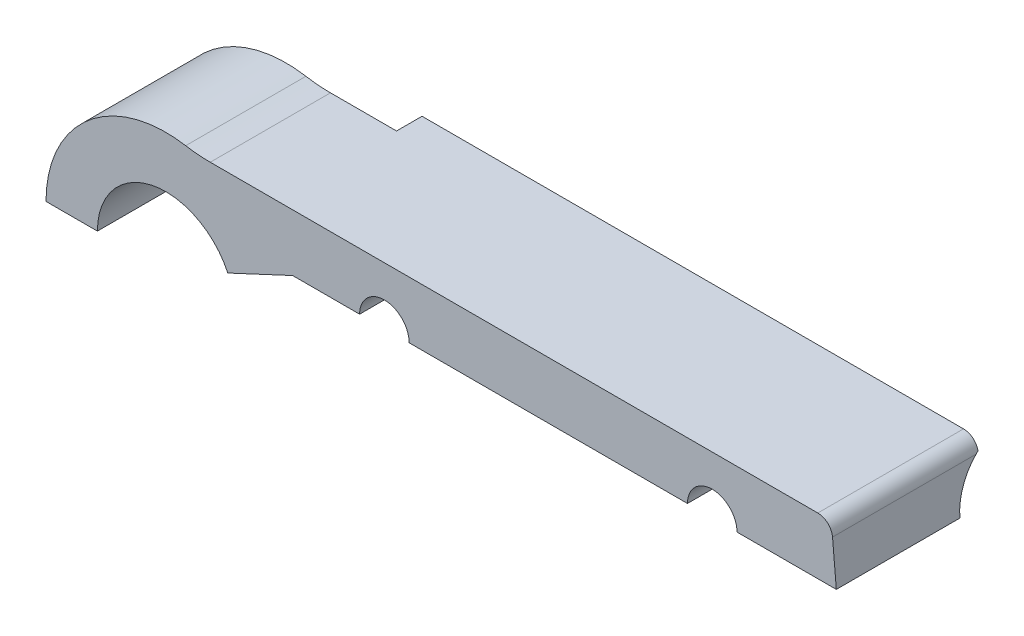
ISO-10303-21;
HEADER;
FILE_DESCRIPTION(('STEP AP214'),'2;1');
FILE_NAME('part.step','',(''),(''),'','','');
FILE_SCHEMA(('AUTOMOTIVE_DESIGN { 1 0 10303 214 1 1 1 1 }'));
ENDSEC;
DATA;
#1=APPLICATION_CONTEXT('core data for automotive mechanical design processes');
#2=APPLICATION_PROTOCOL_DEFINITION('international standard','automotive_design',2000,#1);
#3=PRODUCT_CONTEXT('',#1,'mechanical');
#4=PRODUCT('Part','Part','',(#3));
#5=PRODUCT_RELATED_PRODUCT_CATEGORY('part','',(#4));
#6=PRODUCT_DEFINITION_FORMATION('','',#4);
#7=PRODUCT_DEFINITION_CONTEXT('part definition',#1,'design');
#8=PRODUCT_DEFINITION('design','',#6,#7);
#9=PRODUCT_DEFINITION_SHAPE('','',#8);
#10=(LENGTH_UNIT() NAMED_UNIT(*) SI_UNIT(.MILLI.,.METRE.));
#11=(NAMED_UNIT(*) PLANE_ANGLE_UNIT() SI_UNIT($,.RADIAN.));
#12=(NAMED_UNIT(*) SI_UNIT($,.STERADIAN.) SOLID_ANGLE_UNIT());
#13=UNCERTAINTY_MEASURE_WITH_UNIT(LENGTH_MEASURE(1.E-05),#10,'distance_accuracy_value','');
#14=(GEOMETRIC_REPRESENTATION_CONTEXT(3) GLOBAL_UNCERTAINTY_ASSIGNED_CONTEXT((#13)) GLOBAL_UNIT_ASSIGNED_CONTEXT((#10,
#11,#12)) REPRESENTATION_CONTEXT('',''));
#15=CARTESIAN_POINT('',(0.,0.,0.));
#16=DIRECTION('',(0.,0.,1.));
#17=DIRECTION('',(1.,0.,0.));
#18=AXIS2_PLACEMENT_3D('',#15,#16,#17);
#19=CARTESIAN_POINT('',(17.4133961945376,8.12,-144.932167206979));
#20=DIRECTION('',(0.,-1.,0.));
#21=DIRECTION('',(0.,0.,-1.));
#22=AXIS2_PLACEMENT_3D('',#19,#20,#21);
#23=PLANE('',#22);
#24=DIRECTION('',(1.,0.,0.));
#25=VECTOR('',#24,1.);
#26=CARTESIAN_POINT('',(30.8284770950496,8.12,20.));
#27=LINE('',#26,#25);
#28=CARTESIAN_POINT('',(17.4133961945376,8.12,20.));
#29=VERTEX_POINT('',#28);
#30=CARTESIAN_POINT('',(26.6,8.12,20.));
#31=VERTEX_POINT('',#30);
#32=EDGE_CURVE('E161',#29,#31,#27,.T.);
#33=ORIENTED_EDGE('',*,*,#32,.F.);
#34=DIRECTION('',(0.,0.,1.));
#35=VECTOR('',#34,1.);
#36=CARTESIAN_POINT('',(17.4133961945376,8.12,-144.932167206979));
#37=LINE('',#36,#35);
#38=CARTESIAN_POINT('',(17.4133961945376,8.12,3.5));
#39=VERTEX_POINT('',#38);
#40=EDGE_CURVE('E280',#39,#29,#37,.T.);
#41=ORIENTED_EDGE('',*,*,#40,.F.);
#42=DIRECTION('',(-1.,0.,0.));
#43=VECTOR('',#42,1.);
#44=CARTESIAN_POINT('',(0.,8.12,3.5));
#45=LINE('',#44,#43);
#46=CARTESIAN_POINT('',(20.4466525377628,8.12,3.5));
#47=VERTEX_POINT('',#46);
#48=EDGE_CURVE('E167',#47,#39,#45,.T.);
#49=ORIENTED_EDGE('',*,*,#48,.F.);
#50=DIRECTION('',(0.,0.,-1.));
#51=VECTOR('',#50,1.);
#52=CARTESIAN_POINT('',(20.4466525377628,8.12,3.5));
#53=LINE('',#52,#51);
#54=CARTESIAN_POINT('',(20.4466525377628,8.12,3.045));
#55=VERTEX_POINT('',#54);
#56=EDGE_CURVE('E279',#47,#55,#53,.T.);
#57=ORIENTED_EDGE('',*,*,#56,.T.);
#58=DIRECTION('',(1.,0.,0.));
#59=VECTOR('',#58,1.);
#60=CARTESIAN_POINT('',(-16.445,8.12,3.045));
#61=LINE('',#60,#59);
#62=CARTESIAN_POINT('',(26.6,8.12,3.045));
#63=VERTEX_POINT('',#62);
#64=EDGE_CURVE('E173',#55,#63,#61,.T.);
#65=ORIENTED_EDGE('',*,*,#64,.T.);
#66=DIRECTION('',(0.,0.,1.));
#67=VECTOR('',#66,1.);
#68=CARTESIAN_POINT('',(26.6,8.12,20.));
#69=LINE('',#68,#67);
#70=EDGE_CURVE('E154',#63,#31,#69,.T.);
#71=ORIENTED_EDGE('',*,*,#70,.T.);
#72=EDGE_LOOP('',(#33,#41,#49,#57,#65,#71));
#73=FACE_BOUND('',#72,.T.);
#74=ADVANCED_FACE('F35',(#73),#23,.T.);
#75=CARTESIAN_POINT('',(0.,0.,-144.932167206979));
#76=DIRECTION('',(0.4226182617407,-0.90630778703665,0.));
#77=DIRECTION('',(0.90630778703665,0.4226182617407,0.));
#78=AXIS2_PLACEMENT_3D('',#75,#76,#77);
#79=PLANE('',#78);
#80=DIRECTION('',(0.90630778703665,0.4226182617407,0.));
#81=VECTOR('',#80,1.);
#82=CARTESIAN_POINT('',(17.6637907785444,8.23676091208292,20.));
#83=LINE('',#82,#81);
#84=CARTESIAN_POINT('',(8.51023012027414,3.96838547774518,20.));
#85=VERTEX_POINT('',#84);
#86=EDGE_CURVE('E50',#85,#29,#83,.T.);
#87=ORIENTED_EDGE('',*,*,#86,.F.);
#88=DIRECTION('',(0.,0.,-1.));
#89=VECTOR('',#88,1.);
#90=CARTESIAN_POINT('',(8.51023012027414,3.96838547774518,20.));
#91=LINE('',#90,#89);
#92=CARTESIAN_POINT('',(8.51023012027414,3.96838547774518,3.5));
#93=VERTEX_POINT('',#92);
#94=EDGE_CURVE('E43',#85,#93,#91,.T.);
#95=ORIENTED_EDGE('',*,*,#94,.T.);
#96=DIRECTION('',(-0.90630778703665,-0.4226182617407,0.));
#97=VECTOR('',#96,1.);
#98=CARTESIAN_POINT('',(0.,0.,3.5));
#99=LINE('',#98,#97);
#100=EDGE_CURVE('E190',#39,#93,#99,.T.);
#101=ORIENTED_EDGE('',*,*,#100,.F.);
#102=ORIENTED_EDGE('',*,*,#40,.T.);
#103=EDGE_LOOP('',(#87,#95,#101,#102));
#104=FACE_BOUND('',#103,.T.);
#105=ADVANCED_FACE('F189',(#104),#79,.T.);
#106=CARTESIAN_POINT('',(0.,0.,20.));
#107=DIRECTION('',(0.,0.,-1.));
#108=DIRECTION('',(-1.,0.,0.));
#109=AXIS2_PLACEMENT_3D('',#106,#107,#108);
#110=CYLINDRICAL_SURFACE('',#109,16.445);
#111=DIRECTION('',(0.,0.,-1.));
#112=VECTOR('',#111,1.);
#113=CARTESIAN_POINT('',(-16.445,0.,20.));
#114=LINE('',#113,#112);
#115=CARTESIAN_POINT('',(-16.445,0.,20.));
#116=VERTEX_POINT('',#115);
#117=CARTESIAN_POINT('',(-16.445,0.,3.5));
#118=VERTEX_POINT('',#117);
#119=EDGE_CURVE('E58',#116,#118,#114,.T.);
#120=ORIENTED_EDGE('',*,*,#119,.F.);
#121=CARTESIAN_POINT('',(0.,0.,20.));
#122=DIRECTION('',(0.,0.,1.));
#123=DIRECTION('',(1.,0.,0.));
#124=AXIS2_PLACEMENT_3D('',#121,#122,#123);
#125=CIRCLE('',#124,16.445);
#126=CARTESIAN_POINT('',(2.73037716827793,16.216752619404,20.));
#127=VERTEX_POINT('',#126);
#128=EDGE_CURVE('E330',#127,#116,#125,.T.);
#129=ORIENTED_EDGE('',*,*,#128,.F.);
#130=DIRECTION('',(0.,0.,-1.));
#131=VECTOR('',#130,1.);
#132=CARTESIAN_POINT('',(2.73037716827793,16.216752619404,20.));
#133=LINE('',#132,#131);
#134=CARTESIAN_POINT('',(2.73037716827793,16.216752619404,3.5));
#135=VERTEX_POINT('',#134);
#136=EDGE_CURVE('E332',#127,#135,#133,.T.);
#137=ORIENTED_EDGE('',*,*,#136,.T.);
#138=CARTESIAN_POINT('',(0.,0.,3.5));
#139=DIRECTION('',(0.,0.,-1.));
#140=DIRECTION('',(-1.,0.,0.));
#141=AXIS2_PLACEMENT_3D('',#138,#139,#140);
#142=CIRCLE('',#141,16.445);
#143=EDGE_CURVE('E178',#118,#135,#142,.T.);
#144=ORIENTED_EDGE('',*,*,#143,.F.);
#145=EDGE_LOOP('',(#120,#129,#137,#144));
#146=FACE_BOUND('',#145,.T.);
#147=ADVANCED_FACE('F255',(#146),#110,.T.);
#148=CARTESIAN_POINT('',(30.8284770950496,-19.995,20.));
#149=DIRECTION('',(0.,0.,1.));
#150=DIRECTION('',(1.,0.,0.));
#151=AXIS2_PLACEMENT_3D('',#148,#149,#150);
#152=PLANE('',#151);
#153=ORIENTED_EDGE('',*,*,#128,.T.);
#154=DIRECTION('',(1.,0.,0.));
#155=VECTOR('',#154,1.);
#156=CARTESIAN_POINT('',(30.8284770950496,0.,20.));
#157=LINE('',#156,#155);
#158=CARTESIAN_POINT('',(-9.39,0.,20.));
#159=VERTEX_POINT('',#158);
#160=EDGE_CURVE('E199',#116,#159,#157,.T.);
#161=ORIENTED_EDGE('',*,*,#160,.T.);
#162=CARTESIAN_POINT('',(0.,0.,20.));
#163=DIRECTION('',(0.,0.,-1.));
#164=DIRECTION('',(-1.,0.,0.));
#165=AXIS2_PLACEMENT_3D('',#162,#163,#164);
#166=CIRCLE('',#165,9.39);
#167=EDGE_CURVE('E194',#159,#85,#166,.T.);
#168=ORIENTED_EDGE('',*,*,#167,.T.);
#169=ORIENTED_EDGE('',*,*,#86,.T.);
#170=ORIENTED_EDGE('',*,*,#32,.T.);
#171=CARTESIAN_POINT('',(30.,8.12,20.));
#172=DIRECTION('',(0.,0.,1.));
#173=DIRECTION('',(1.,0.,0.));
#174=AXIS2_PLACEMENT_3D('',#171,#172,#173);
#175=CIRCLE('',#174,3.39999999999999);
#176=CARTESIAN_POINT('',(33.4,8.12,20.));
#177=VERTEX_POINT('',#176);
#178=EDGE_CURVE('E151',#177,#31,#175,.T.);
#179=ORIENTED_EDGE('',*,*,#178,.F.);
#180=CARTESIAN_POINT('',(71.6,8.12,20.));
#181=VERTEX_POINT('',#180);
#182=EDGE_CURVE('E170',#177,#181,#27,.T.);
#183=ORIENTED_EDGE('',*,*,#182,.T.);
#184=CARTESIAN_POINT('',(75.,8.12,20.));
#185=DIRECTION('',(0.,0.,1.));
#186=DIRECTION('',(1.,0.,0.));
#187=AXIS2_PLACEMENT_3D('',#184,#185,#186);
#188=CIRCLE('',#187,3.39999999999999);
#189=CARTESIAN_POINT('',(78.4,8.12,20.));
#190=VERTEX_POINT('',#189);
#191=EDGE_CURVE('E239',#190,#181,#188,.T.);
#192=ORIENTED_EDGE('',*,*,#191,.F.);
#193=CARTESIAN_POINT('',(92.0337239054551,8.12,20.));
#194=VERTEX_POINT('',#193);
#195=EDGE_CURVE('E169',#190,#194,#27,.T.);
#196=ORIENTED_EDGE('',*,*,#195,.T.);
#197=DIRECTION('',(-0.0871557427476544,0.996194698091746,0.));
#198=VECTOR('',#197,1.);
#199=CARTESIAN_POINT('',(91.5121229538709,14.0819261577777,20.));
#200=LINE('',#199,#198);
#201=CARTESIAN_POINT('',(91.5121229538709,14.0819261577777,20.));
#202=VERTEX_POINT('',#201);
#203=EDGE_CURVE('E322',#194,#202,#200,.T.);
#204=ORIENTED_EDGE('',*,*,#203,.T.);
#205=CARTESIAN_POINT('',(89.4898477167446,13.905,20.));
#206=DIRECTION('',(0.,0.,1.));
#207=DIRECTION('',(-1.,0.,0.));
#208=AXIS2_PLACEMENT_3D('',#205,#206,#207);
#209=CIRCLE('',#208,2.03);
#210=CARTESIAN_POINT('',(89.4898477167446,15.935,20.));
#211=VERTEX_POINT('',#210);
#212=EDGE_CURVE('E324',#202,#211,#209,.T.);
#213=ORIENTED_EDGE('',*,*,#212,.T.);
#214=DIRECTION('',(-1.,0.,0.));
#215=VECTOR('',#214,1.);
#216=CARTESIAN_POINT('',(6.10080322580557,15.935,20.));
#217=LINE('',#216,#215);
#218=CARTESIAN_POINT('',(6.10080322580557,15.935,20.));
#219=VERTEX_POINT('',#218);
#220=EDGE_CURVE('E326',#211,#219,#217,.T.);
#221=ORIENTED_EDGE('',*,*,#220,.T.);
#222=CARTESIAN_POINT('',(6.10080322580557,36.235,20.));
#223=DIRECTION('',(0.,0.,-1.));
#224=DIRECTION('',(1.,0.,0.));
#225=AXIS2_PLACEMENT_3D('',#222,#223,#224);
#226=CIRCLE('',#225,20.3);
#227=EDGE_CURVE('E328',#219,#127,#226,.T.);
#228=ORIENTED_EDGE('',*,*,#227,.T.);
#229=EDGE_LOOP('',(#153,#161,#168,#169,#170,#179,#183,#192,#196,#204,#213,#221,#228));
#230=FACE_BOUND('',#229,.T.);
#231=ADVANCED_FACE('F162',(#230),#152,.T.);
#232=CARTESIAN_POINT('',(0.,0.,3.5));
#233=DIRECTION('',(0.,0.,-1.));
#234=DIRECTION('',(-1.,0.,0.));
#235=AXIS2_PLACEMENT_3D('',#232,#233,#234);
#236=PLANE('',#235);
#237=CARTESIAN_POINT('',(0.,0.,3.5));
#238=DIRECTION('',(0.,0.,-1.));
#239=DIRECTION('',(-1.,0.,0.));
#240=AXIS2_PLACEMENT_3D('',#237,#238,#239);
#241=CIRCLE('',#240,9.39);
#242=CARTESIAN_POINT('',(-9.39,0.,3.5));
#243=VERTEX_POINT('',#242);
#244=EDGE_CURVE('E197',#243,#93,#241,.T.);
#245=ORIENTED_EDGE('',*,*,#244,.F.);
#246=DIRECTION('',(-1.,0.,0.));
#247=VECTOR('',#246,1.);
#248=CARTESIAN_POINT('',(0.,0.,3.5));
#249=LINE('',#248,#247);
#250=EDGE_CURVE('E292',#243,#118,#249,.T.);
#251=ORIENTED_EDGE('',*,*,#250,.T.);
#252=ORIENTED_EDGE('',*,*,#143,.T.);
#253=CARTESIAN_POINT('',(6.10080322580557,36.235,3.5));
#254=DIRECTION('',(0.,0.,-1.));
#255=DIRECTION('',(-1.,0.,0.));
#256=AXIS2_PLACEMENT_3D('',#253,#254,#255);
#257=CIRCLE('',#256,20.3);
#258=CARTESIAN_POINT('',(6.10080322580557,15.935,3.5));
#259=VERTEX_POINT('',#258);
#260=EDGE_CURVE('E312',#135,#259,#257,.F.);
#261=ORIENTED_EDGE('',*,*,#260,.T.);
#262=DIRECTION('',(1.,0.,0.));
#263=VECTOR('',#262,1.);
#264=CARTESIAN_POINT('',(6.10080322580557,15.935,3.5));
#265=LINE('',#264,#263);
#266=CARTESIAN_POINT('',(15.1682489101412,15.935,3.5));
#267=VERTEX_POINT('',#266);
#268=EDGE_CURVE('E308',#259,#267,#265,.T.);
#269=ORIENTED_EDGE('',*,*,#268,.T.);
#270=CARTESIAN_POINT('',(0.,0.,3.5));
#271=DIRECTION('',(0.,0.,-1.));
#272=DIRECTION('',(-1.,0.,0.));
#273=AXIS2_PLACEMENT_3D('',#270,#271,#272);
#274=CIRCLE('',#273,22.);
#275=EDGE_CURVE('E306',#267,#47,#274,.T.);
#276=ORIENTED_EDGE('',*,*,#275,.T.);
#277=ORIENTED_EDGE('',*,*,#48,.T.);
#278=ORIENTED_EDGE('',*,*,#100,.T.);
#279=EDGE_LOOP('',(#245,#251,#252,#261,#269,#276,#277,#278));
#280=FACE_BOUND('',#279,.T.);
#281=ADVANCED_FACE('F227',(#280),#236,.T.);
#282=CARTESIAN_POINT('',(0.,0.,3.5));
#283=DIRECTION('',(0.,0.,-1.));
#284=DIRECTION('',(-1.,0.,0.));
#285=AXIS2_PLACEMENT_3D('',#282,#283,#284);
#286=CYLINDRICAL_SURFACE('',#285,22.);
#287=ORIENTED_EDGE('',*,*,#56,.F.);
#288=ORIENTED_EDGE('',*,*,#275,.F.);
#289=DIRECTION('',(0.,0.,-1.));
#290=VECTOR('',#289,1.);
#291=CARTESIAN_POINT('',(15.1682489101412,15.935,3.5));
#292=LINE('',#291,#290);
#293=CARTESIAN_POINT('',(15.1682489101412,15.935,0.));
#294=VERTEX_POINT('',#293);
#295=EDGE_CURVE('E310',#294,#267,#292,.F.);
#296=ORIENTED_EDGE('',*,*,#295,.F.);
#297=CARTESIAN_POINT('',(0.,0.,0.));
#298=DIRECTION('',(0.,0.,-1.));
#299=DIRECTION('',(-1.,0.,0.));
#300=AXIS2_PLACEMENT_3D('',#297,#298,#299);
#301=CIRCLE('',#300,22.);
#302=CARTESIAN_POINT('',(16.7096325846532,14.3104220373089,0.));
#303=VERTEX_POINT('',#302);
#304=EDGE_CURVE('E302',#294,#303,#301,.T.);
#305=ORIENTED_EDGE('',*,*,#304,.T.);
#306=CARTESIAN_POINT('',(16.7096325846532,14.3104220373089,0.));
#307=CARTESIAN_POINT('',(16.7869290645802,14.2201700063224,0.117114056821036));
#308=CARTESIAN_POINT('',(16.8654322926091,14.1270211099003,0.231140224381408));
#309=CARTESIAN_POINT('',(17.024305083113,13.9351545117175,0.453000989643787));
#310=CARTESIAN_POINT('',(17.1046743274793,13.8364377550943,0.56083663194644));
#311=CARTESIAN_POINT('',(17.3477648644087,13.5322703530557,0.875045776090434));
#312=CARTESIAN_POINT('',(17.5125035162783,13.3187625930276,1.07217313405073));
#313=CARTESIAN_POINT('',(17.8442086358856,12.870985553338,1.4418475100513));
#314=CARTESIAN_POINT('',(18.0111817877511,12.6366272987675,1.61428010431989));
#315=CARTESIAN_POINT('',(18.34341232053,12.1493261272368,1.93249108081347));
#316=CARTESIAN_POINT('',(18.5086699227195,11.8963856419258,2.0782729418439));
#317=CARTESIAN_POINT('',(18.8110840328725,11.4110791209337,2.3226602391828));
#318=CARTESIAN_POINT('',(18.9488618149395,11.1809913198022,2.42503574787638));
#319=CARTESIAN_POINT('',(19.2193206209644,10.7094141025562,2.60787811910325));
#320=CARTESIAN_POINT('',(19.3520026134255,10.467926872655,2.68834916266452));
#321=CARTESIAN_POINT('',(19.6104360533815,9.97536966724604,2.82585949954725));
#322=CARTESIAN_POINT('',(19.7362000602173,9.7243185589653,2.8829425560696));
#323=CARTESIAN_POINT('',(19.9795607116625,9.21395872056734,2.97238789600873));
#324=CARTESIAN_POINT('',(20.0971579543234,8.9546505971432,3.00475199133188));
#325=CARTESIAN_POINT('',(20.3146521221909,8.4489705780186,3.04188483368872));
#326=CARTESIAN_POINT('',(20.4152140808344,8.20301941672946,3.04848005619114));
#327=CARTESIAN_POINT('',(20.6071966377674,7.70804022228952,3.03805821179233));
#328=CARTESIAN_POINT('',(20.6986175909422,7.45901230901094,3.02104206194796));
#329=CARTESIAN_POINT('',(20.8715054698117,6.96058785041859,2.96258652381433));
#330=CARTESIAN_POINT('',(20.9529808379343,6.71119180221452,2.92116802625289));
#331=CARTESIAN_POINT('',(21.1055862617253,6.21463248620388,2.81342327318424));
#332=CARTESIAN_POINT('',(21.1767180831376,5.96746884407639,2.74710127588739));
#333=CARTESIAN_POINT('',(21.2990827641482,5.51328152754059,2.60073864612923));
#334=CARTESIAN_POINT('',(21.351706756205,5.30556076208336,2.52400385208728));
#335=CARTESIAN_POINT('',(21.449346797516,4.89590063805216,2.35240872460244));
#336=CARTESIAN_POINT('',(21.4943634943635,4.69396078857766,2.25754993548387));
#337=CARTESIAN_POINT('',(21.5770641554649,4.29781991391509,2.05020139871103));
#338=CARTESIAN_POINT('',(21.6147490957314,4.1036178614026,1.93771400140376));
#339=CARTESIAN_POINT('',(21.6832408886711,3.72479598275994,1.69582456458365));
#340=CARTESIAN_POINT('',(21.7140489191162,3.54017451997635,1.56642542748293));
#341=CARTESIAN_POINT('',(21.7623836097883,3.22753525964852,1.32642856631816));
#342=CARTESIAN_POINT('',(21.7812987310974,3.097009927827,1.21935141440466));
#343=CARTESIAN_POINT('',(21.8159151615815,2.84293458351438,0.996743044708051));
#344=CARTESIAN_POINT('',(21.8316167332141,2.71938400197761,0.881212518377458));
#345=CARTESIAN_POINT('',(21.8601012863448,2.48001755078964,0.6423351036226));
#346=CARTESIAN_POINT('',(21.872887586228,2.36419299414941,0.518997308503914));
#347=CARTESIAN_POINT('',(21.8958950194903,2.14065652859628,0.264913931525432));
#348=CARTESIAN_POINT('',(21.9061157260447,2.03294597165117,0.134167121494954));
#349=CARTESIAN_POINT('',(21.9152168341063,1.92957796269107,0.));
#350=B_SPLINE_CURVE_WITH_KNOTS('',3,(#306,#307,#308,#309,#310,#311,#312,#313,#314,#315,#316,
#317,#318,#319,#320,#321,#322,#323,#324,#325,#326,#327,#328,#329,#330,#331,#332,#333,#334,#335,
#336,#337,#338,#339,#340,#341,#342,#343,#344,#345,#346,#347,#348,#349),.UNSPECIFIED.,.F.,.F.,(4,
2,2,2,2,2,2,2,2,2,2,2,2,2,2,2,2,2,2,2,2,4),(0.,0.50038990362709,1.00069512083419,2.001084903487,
3.00596962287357,4.01072307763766,4.87086930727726,5.73085124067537,6.58921655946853,
7.44751895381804,8.24374704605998,9.03994421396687,9.83546074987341,10.6308413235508,
11.3127782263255,11.9946570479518,12.6764450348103,13.3581161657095,13.8674030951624,
14.3766484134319,14.8853111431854,15.3940584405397),.UNSPECIFIED.);
#351=EDGE_CURVE('E174',#303,#55,#350,.T.);
#352=ORIENTED_EDGE('',*,*,#351,.T.);
#353=EDGE_LOOP('',(#287,#288,#296,#305,#352));
#354=FACE_BOUND('',#353,.T.);
#355=ADVANCED_FACE('F224',(#354),#286,.F.);
#356=CARTESIAN_POINT('',(-16.445,8.12,-4.77));
#357=DIRECTION('',(1.,0.,0.));
#358=DIRECTION('',(0.,0.,-1.));
#359=AXIS2_PLACEMENT_3D('',#356,#357,#358);
#360=CYLINDRICAL_SURFACE('',#359,7.815);
#361=ORIENTED_EDGE('',*,*,#64,.F.);
#362=ORIENTED_EDGE('',*,*,#351,.F.);
#363=DIRECTION('',(1.,0.,0.));
#364=VECTOR('',#363,1.);
#365=CARTESIAN_POINT('',(-16.445,14.3104220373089,0.));
#366=LINE('',#365,#364);
#367=CARTESIAN_POINT('',(91.4789512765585,14.3104220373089,0.));
#368=VERTEX_POINT('',#367);
#369=EDGE_CURVE('E200',#368,#303,#366,.F.);
#370=ORIENTED_EDGE('',*,*,#369,.F.);
#371=CARTESIAN_POINT('',(91.5121229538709,14.0819261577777,0.282688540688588));
#372=CARTESIAN_POINT('',(91.5104042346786,14.1015699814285,0.259509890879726));
#373=CARTESIAN_POINT('',(91.5084100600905,14.1210682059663,0.236228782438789));
#374=CARTESIAN_POINT('',(91.5038926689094,14.1597591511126,0.189481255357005));
#375=CARTESIAN_POINT('',(91.5013696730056,14.1789519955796,0.166014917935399));
#376=CARTESIAN_POINT('',(91.4958150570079,14.2170341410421,0.118897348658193));
#377=CARTESIAN_POINT('',(91.4927834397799,14.2359234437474,0.0952461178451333));
#378=CARTESIAN_POINT('',(91.4862300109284,14.2734015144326,0.0477578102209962));
#379=CARTESIAN_POINT('',(91.482707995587,14.2919901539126,0.0239206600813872));
#380=CARTESIAN_POINT('',(91.4789512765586,14.3104220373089,0.));
#381=B_SPLINE_CURVE_WITH_KNOTS('',3,(#371,#372,#373,#374,#375,#376,#377,#378,#379,#380),
.UNSPECIFIED.,.F.,.F.,(4,2,2,2,4),(0.,0.0912925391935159,0.182547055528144,0.273801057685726,
0.3650930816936),.UNSPECIFIED.);
#382=CARTESIAN_POINT('',(91.5121229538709,14.0819261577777,0.282688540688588));
#383=VERTEX_POINT('',#382);
#384=EDGE_CURVE('E203',#383,#368,#381,.T.);
#385=ORIENTED_EDGE('',*,*,#384,.F.);
#386=CARTESIAN_POINT('',(92.0337239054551,8.12,-4.77));
#387=DIRECTION('',(-0.996194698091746,-0.0871557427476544,0.));
#388=DIRECTION('',(0.0871557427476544,-0.996194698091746,0.));
#389=AXIS2_PLACEMENT_3D('',#386,#387,#388);
#390=ELLIPSE('',#389,7.84485203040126,7.815);
#391=CARTESIAN_POINT('',(92.0337239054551,8.12,3.04500000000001));
#392=VERTEX_POINT('',#391);
#393=EDGE_CURVE('E214',#392,#383,#390,.T.);
#394=ORIENTED_EDGE('',*,*,#393,.F.);
#395=CARTESIAN_POINT('',(78.4,8.12,3.045));
#396=VERTEX_POINT('',#395);
#397=EDGE_CURVE('E276',#396,#392,#61,.T.);
#398=ORIENTED_EDGE('',*,*,#397,.F.);
#399=CARTESIAN_POINT('',(78.4,8.12,3.045));
#400=CARTESIAN_POINT('',(78.3999992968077,8.21074674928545,3.04499942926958));
#401=CARTESIAN_POINT('',(78.3963619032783,8.30151946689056,3.04341505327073));
#402=CARTESIAN_POINT('',(78.3818486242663,8.48241256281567,3.03711752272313));
#403=CARTESIAN_POINT('',(78.3709684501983,8.57253252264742,3.03240251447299));
#404=CARTESIAN_POINT('',(78.3420540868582,8.75159312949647,3.01995367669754));
#405=CARTESIAN_POINT('',(78.324006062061,8.84053114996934,3.01221400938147));
#406=CARTESIAN_POINT('',(78.280951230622,9.01642252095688,2.99392251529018));
#407=CARTESIAN_POINT('',(78.2559415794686,9.10337504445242,2.98336953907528));
#408=CARTESIAN_POINT('',(78.1710305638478,9.3596783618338,2.94796423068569));
#409=CARTESIAN_POINT('',(78.1011101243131,9.52530913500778,2.91930381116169));
#410=CARTESIAN_POINT('',(77.9369773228,9.84222982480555,2.85459183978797));
#411=CARTESIAN_POINT('',(77.8427711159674,9.99352336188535,2.81854216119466));
#412=CARTESIAN_POINT('',(77.6273797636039,10.2859720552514,2.74044548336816));
#413=CARTESIAN_POINT('',(77.5050964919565,10.4262638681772,2.69819084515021));
#414=CARTESIAN_POINT('',(77.2393569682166,10.6850974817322,2.61329859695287));
#415=CARTESIAN_POINT('',(77.0958886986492,10.8036268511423,2.57066078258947));
#416=CARTESIAN_POINT('',(76.7823467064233,11.0220146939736,2.48720033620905));
#417=CARTESIAN_POINT('',(76.6112463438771,11.1204955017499,2.44660492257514));
#418=CARTESIAN_POINT('',(76.2528972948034,11.2868930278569,2.37515745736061));
#419=CARTESIAN_POINT('',(76.0656577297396,11.3548268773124,2.34429994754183));
#420=CARTESIAN_POINT('',(75.6902932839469,11.454552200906,2.29808923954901));
#421=CARTESIAN_POINT('',(75.5027036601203,11.4880147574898,2.28202367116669));
#422=CARTESIAN_POINT('',(75.1239376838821,11.5230502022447,2.26518965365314));
#423=CARTESIAN_POINT('',(74.9327636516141,11.5246430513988,2.26441162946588));
#424=CARTESIAN_POINT('',(74.5696293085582,11.4971443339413,2.2776433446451));
#425=CARTESIAN_POINT('',(74.3974172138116,11.4706497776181,2.29040157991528));
#426=CARTESIAN_POINT('',(74.0601827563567,11.3921141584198,2.32713697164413));
#427=CARTESIAN_POINT('',(73.8951619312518,11.3400676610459,2.35111651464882));
#428=CARTESIAN_POINT('',(73.5726453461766,11.210876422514,2.40814520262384));
#429=CARTESIAN_POINT('',(73.415396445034,11.1332024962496,2.44138305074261));
#430=CARTESIAN_POINT('',(73.1155175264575,10.9553393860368,2.51314894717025));
#431=CARTESIAN_POINT('',(72.9728935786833,10.8551409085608,2.55167917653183));
#432=CARTESIAN_POINT('',(72.6923614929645,10.6241572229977,2.63403874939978));
#433=CARTESIAN_POINT('',(72.5561232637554,10.4913949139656,2.67802779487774));
#434=CARTESIAN_POINT('',(72.3072555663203,10.204513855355,2.76335321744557));
#435=CARTESIAN_POINT('',(72.1946326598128,10.0503891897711,2.80468885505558));
#436=CARTESIAN_POINT('',(71.9934355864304,9.7196922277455,2.88145456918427));
#437=CARTESIAN_POINT('',(71.905599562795,9.54262305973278,2.91669324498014));
#438=CARTESIAN_POINT('',(71.7615593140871,9.17429506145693,2.97579769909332));
#439=CARTESIAN_POINT('',(71.7053359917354,8.9830448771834,2.99967034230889));
#440=CARTESIAN_POINT('',(71.6297483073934,8.60568751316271,3.03203458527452));
#441=CARTESIAN_POINT('',(71.6081465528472,8.42010851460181,3.04145795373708));
#442=CARTESIAN_POINT('',(71.5956721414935,8.04775038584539,3.04688106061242));
#443=CARTESIAN_POINT('',(71.6047896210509,7.86097166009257,3.04288510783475));
#444=CARTESIAN_POINT('',(71.6519472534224,7.50238481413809,3.02251438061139));
#445=CARTESIAN_POINT('',(71.6883646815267,7.33031913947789,3.00683441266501));
#446=CARTESIAN_POINT('',(71.7867717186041,6.99496025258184,2.96544282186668));
#447=CARTESIAN_POINT('',(71.8487644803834,6.83166812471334,2.93972996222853));
#448=CARTESIAN_POINT('',(71.9985616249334,6.51270861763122,2.87970662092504));
#449=CARTESIAN_POINT('',(72.0871120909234,6.3574389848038,2.84515257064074));
#450=CARTESIAN_POINT('',(72.2866967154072,6.06340238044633,2.77106487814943));
#451=CARTESIAN_POINT('',(72.3977405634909,5.92464256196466,2.73152909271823));
#452=CARTESIAN_POINT('',(72.6492022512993,5.65623607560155,2.64790785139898));
#453=CARTESIAN_POINT('',(72.7912297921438,5.52812954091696,2.60370728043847));
#454=CARTESIAN_POINT('',(73.0953704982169,5.29708118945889,2.51838524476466));
#455=CARTESIAN_POINT('',(73.2574898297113,5.19414712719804,2.47726473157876));
#456=CARTESIAN_POINT('',(73.6017082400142,5.01465257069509,2.40221959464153));
#457=CARTESIAN_POINT('',(73.7841437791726,4.93866459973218,2.36845646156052));
#458=CARTESIAN_POINT('',(74.1611652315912,4.81918721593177,2.31401360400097));
#459=CARTESIAN_POINT('',(74.3557397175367,4.77566772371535,2.29332177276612));
#460=CARTESIAN_POINT('',(74.7342813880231,4.72547452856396,2.26932702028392));
#461=CARTESIAN_POINT('',(74.9178050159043,4.7160650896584,2.2647340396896));
#462=CARTESIAN_POINT('',(75.2837419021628,4.72692241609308,2.26997807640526));
#463=CARTESIAN_POINT('',(75.4661553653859,4.74718352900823,2.27981234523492));
#464=CARTESIAN_POINT('',(75.8142448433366,4.81444300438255,2.31157961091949));
#465=CARTESIAN_POINT('',(75.9802886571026,4.85990130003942,2.33281368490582));
#466=CARTESIAN_POINT('',(76.3023936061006,4.97468210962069,2.38437882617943));
#467=CARTESIAN_POINT('',(76.4584518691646,5.04401145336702,2.41471249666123));
#468=CARTESIAN_POINT('',(76.7668901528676,5.20956358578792,2.48341906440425));
#469=CARTESIAN_POINT('',(76.9184218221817,5.30720333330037,2.52217753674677));
#470=CARTESIAN_POINT('',(77.2038045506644,5.52472402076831,2.60239372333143));
#471=CARTESIAN_POINT('',(77.337648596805,5.64461373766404,2.64385249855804));
#472=CARTESIAN_POINT('',(77.5952142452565,5.91488593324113,2.72889174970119));
#473=CARTESIAN_POINT('',(77.7171947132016,6.06696641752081,2.77236581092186));
#474=CARTESIAN_POINT('',(77.9340903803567,6.39110593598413,2.85318472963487));
#475=CARTESIAN_POINT('',(78.0289932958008,6.56317398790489,2.89052680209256));
#476=CARTESIAN_POINT('',(78.1478707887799,6.83145131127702,2.93856997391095));
#477=CARTESIAN_POINT('',(78.1834354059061,6.92198506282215,2.95318998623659));
#478=CARTESIAN_POINT('',(78.2467734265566,7.10613465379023,2.97951131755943));
#479=CARTESIAN_POINT('',(78.2745505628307,7.1997489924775,2.99121403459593));
#480=CARTESIAN_POINT('',(78.321944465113,7.38911401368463,3.01132908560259));
#481=CARTESIAN_POINT('',(78.3415809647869,7.48485893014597,3.01974937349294));
#482=CARTESIAN_POINT('',(78.3725461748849,7.67787751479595,3.03308241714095));
#483=CARTESIAN_POINT('',(78.3838807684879,7.77515005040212,3.03799765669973));
#484=CARTESIAN_POINT('',(78.3939972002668,7.91387860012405,3.04238996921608));
#485=CARTESIAN_POINT('',(78.3962474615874,7.95506243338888,3.04336803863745));
#486=CARTESIAN_POINT('',(78.3992490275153,8.03749572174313,3.0446731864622));
#487=CARTESIAN_POINT('',(78.4000003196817,8.07874517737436,3.04500025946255));
#488=CARTESIAN_POINT('',(78.4,8.12,3.045));
#489=B_SPLINE_CURVE_WITH_KNOTS('',3,(#399,#400,#401,#402,#403,#404,#405,#406,#407,#408,#409,
#410,#411,#412,#413,#414,#415,#416,#417,#418,#419,#420,#421,#422,#423,#424,#425,#426,#427,#428,
#429,#430,#431,#432,#433,#434,#435,#436,#437,#438,#439,#440,#441,#442,#443,#444,#445,#446,#447,
#448,#449,#450,#451,#452,#453,#454,#455,#456,#457,#458,#459,#460,#461,#462,#463,#464,#465,#466,
#467,#468,#469,#470,#471,#472,#473,#474,#475,#476,#477,#478,#479,#480,#481,#482,#483,#484,#485,
#486,#487,#488),.UNSPECIFIED.,.T.,.F.,(4,2,2,2,2,2,2,2,2,2,2,2,2,2,2,2,2,2,2,2,2,2,2,2,2,2,2,2,
2,2,2,2,2,2,2,2,2,2,2,2,2,2,2,2,4),(0.,0.272198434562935,0.544558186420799,0.817446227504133,
1.09044593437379,1.63393457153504,2.17728559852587,2.74733274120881,3.31770450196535,
3.91930654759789,4.52057078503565,5.0910775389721,5.6612269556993,6.18290723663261,
6.70469851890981,7.23801987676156,7.77156168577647,8.35468502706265,8.93797018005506,
9.53713411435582,10.1359357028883,10.6942039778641,11.2522930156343,11.7796051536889,
12.3069823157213,12.8508402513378,13.3949329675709,13.981200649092,14.5676487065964,
15.1659002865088,15.7635969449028,16.312141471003,16.8605815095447,17.378701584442,
17.8969700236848,18.4478277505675,18.9989032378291,19.5953578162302,20.1920825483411,
20.4868375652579,20.7814510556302,21.0753461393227,21.3690327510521,21.492777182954,
21.6165226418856),.UNSPECIFIED.);
#490=CARTESIAN_POINT('',(71.6,8.12,3.045));
#491=VERTEX_POINT('',#490);
#492=EDGE_CURVE('E205',#396,#491,#489,.T.);
#493=ORIENTED_EDGE('',*,*,#492,.T.);
#494=CARTESIAN_POINT('',(33.4,8.12,3.045));
#495=VERTEX_POINT('',#494);
#496=EDGE_CURVE('E166',#495,#491,#61,.T.);
#497=ORIENTED_EDGE('',*,*,#496,.F.);
#498=CARTESIAN_POINT('',(33.4,8.12,3.045));
#499=CARTESIAN_POINT('',(33.3999992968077,8.21074674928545,3.04499942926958));
#500=CARTESIAN_POINT('',(33.3963619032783,8.30151946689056,3.04341505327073));
#501=CARTESIAN_POINT('',(33.3818486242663,8.48241256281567,3.03711752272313));
#502=CARTESIAN_POINT('',(33.3709684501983,8.57253252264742,3.03240251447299));
#503=CARTESIAN_POINT('',(33.3420540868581,8.75159312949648,3.01995367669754));
#504=CARTESIAN_POINT('',(33.324006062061,8.84053114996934,3.01221400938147));
#505=CARTESIAN_POINT('',(33.280951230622,9.01642252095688,2.99392251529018));
#506=CARTESIAN_POINT('',(33.2559415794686,9.10337504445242,2.98336953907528));
#507=CARTESIAN_POINT('',(33.1710305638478,9.3596783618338,2.94796423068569));
#508=CARTESIAN_POINT('',(33.1011101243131,9.52530913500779,2.91930381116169));
#509=CARTESIAN_POINT('',(32.9369773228,9.84222982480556,2.85459183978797));
#510=CARTESIAN_POINT('',(32.8427711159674,9.99352336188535,2.81854216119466));
#511=CARTESIAN_POINT('',(32.6273797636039,10.2859720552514,2.74044548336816));
#512=CARTESIAN_POINT('',(32.5050964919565,10.4262638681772,2.69819084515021));
#513=CARTESIAN_POINT('',(32.2393569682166,10.6850974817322,2.61329859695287));
#514=CARTESIAN_POINT('',(32.0958886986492,10.8036268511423,2.57066078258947));
#515=CARTESIAN_POINT('',(31.7823467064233,11.0220146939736,2.48720033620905));
#516=CARTESIAN_POINT('',(31.6112463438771,11.1204955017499,2.44660492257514));
#517=CARTESIAN_POINT('',(31.2528972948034,11.2868930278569,2.37515745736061));
#518=CARTESIAN_POINT('',(31.0656577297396,11.3548268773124,2.34429994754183));
#519=CARTESIAN_POINT('',(30.6902932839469,11.454552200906,2.29808923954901));
#520=CARTESIAN_POINT('',(30.5027036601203,11.4880147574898,2.28202367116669));
#521=CARTESIAN_POINT('',(30.1239376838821,11.5230502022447,2.26518965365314));
#522=CARTESIAN_POINT('',(29.9327636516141,11.5246430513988,2.26441162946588));
#523=CARTESIAN_POINT('',(29.5696293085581,11.4971443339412,2.2776433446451));
#524=CARTESIAN_POINT('',(29.3974172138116,11.4706497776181,2.29040157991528));
#525=CARTESIAN_POINT('',(29.0601827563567,11.3921141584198,2.32713697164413));
#526=CARTESIAN_POINT('',(28.8951619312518,11.3400676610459,2.35111651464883));
#527=CARTESIAN_POINT('',(28.5726453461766,11.210876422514,2.40814520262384));
#528=CARTESIAN_POINT('',(28.415396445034,11.1332024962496,2.44138305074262));
#529=CARTESIAN_POINT('',(28.1155175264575,10.9553393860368,2.51314894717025));
#530=CARTESIAN_POINT('',(27.9728935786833,10.8551409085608,2.55167917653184));
#531=CARTESIAN_POINT('',(27.6923614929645,10.6241572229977,2.63403874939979));
#532=CARTESIAN_POINT('',(27.5561232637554,10.4913949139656,2.67802779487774));
#533=CARTESIAN_POINT('',(27.3072555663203,10.204513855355,2.76335321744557));
#534=CARTESIAN_POINT('',(27.1946326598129,10.0503891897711,2.80468885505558));
#535=CARTESIAN_POINT('',(26.9934355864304,9.7196922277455,2.88145456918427));
#536=CARTESIAN_POINT('',(26.905599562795,9.54262305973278,2.91669324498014));
#537=CARTESIAN_POINT('',(26.7615593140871,9.17429506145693,2.97579769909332));
#538=CARTESIAN_POINT('',(26.7053359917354,8.98304487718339,2.99967034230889));
#539=CARTESIAN_POINT('',(26.6297483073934,8.6056875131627,3.03203458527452));
#540=CARTESIAN_POINT('',(26.6081465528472,8.4201085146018,3.04145795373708));
#541=CARTESIAN_POINT('',(26.5956721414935,8.04775038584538,3.04688106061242));
#542=CARTESIAN_POINT('',(26.6047896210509,7.86097166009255,3.04288510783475));
#543=CARTESIAN_POINT('',(26.6519472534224,7.50238481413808,3.02251438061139));
#544=CARTESIAN_POINT('',(26.6883646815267,7.33031913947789,3.00683441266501));
#545=CARTESIAN_POINT('',(26.7867717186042,6.99496025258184,2.96544282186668));
#546=CARTESIAN_POINT('',(26.8487644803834,6.83166812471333,2.93972996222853));
#547=CARTESIAN_POINT('',(26.9985616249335,6.51270861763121,2.87970662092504));
#548=CARTESIAN_POINT('',(27.0871120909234,6.35743898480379,2.84515257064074));
#549=CARTESIAN_POINT('',(27.2866967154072,6.06340238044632,2.77106487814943));
#550=CARTESIAN_POINT('',(27.3977405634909,5.92464256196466,2.73152909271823));
#551=CARTESIAN_POINT('',(27.6492022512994,5.65623607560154,2.64790785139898));
#552=CARTESIAN_POINT('',(27.7912297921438,5.52812954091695,2.60370728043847));
#553=CARTESIAN_POINT('',(28.0953704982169,5.29708118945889,2.51838524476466));
#554=CARTESIAN_POINT('',(28.2574898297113,5.19414712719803,2.47726473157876));
#555=CARTESIAN_POINT('',(28.6017082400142,5.01465257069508,2.40221959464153));
#556=CARTESIAN_POINT('',(28.7841437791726,4.93866459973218,2.36845646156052));
#557=CARTESIAN_POINT('',(29.1611652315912,4.81918721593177,2.31401360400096));
#558=CARTESIAN_POINT('',(29.3557397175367,4.77566772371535,2.29332177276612));
#559=CARTESIAN_POINT('',(29.7342813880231,4.72547452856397,2.26932702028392));
#560=CARTESIAN_POINT('',(29.9178050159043,4.7160650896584,2.2647340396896));
#561=CARTESIAN_POINT('',(30.2837419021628,4.72692241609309,2.26997807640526));
#562=CARTESIAN_POINT('',(30.466155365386,4.74718352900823,2.27981234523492));
#563=CARTESIAN_POINT('',(30.8142448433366,4.81444300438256,2.31157961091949));
#564=CARTESIAN_POINT('',(30.9802886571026,4.85990130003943,2.33281368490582));
#565=CARTESIAN_POINT('',(31.3023936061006,4.97468210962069,2.38437882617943));
#566=CARTESIAN_POINT('',(31.4584518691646,5.04401145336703,2.41471249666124));
#567=CARTESIAN_POINT('',(31.7668901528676,5.20956358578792,2.48341906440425));
#568=CARTESIAN_POINT('',(31.9184218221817,5.30720333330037,2.52217753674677));
#569=CARTESIAN_POINT('',(32.2038045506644,5.52472402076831,2.60239372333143));
#570=CARTESIAN_POINT('',(32.337648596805,5.64461373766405,2.64385249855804));
#571=CARTESIAN_POINT('',(32.5952142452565,5.91488593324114,2.72889174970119));
#572=CARTESIAN_POINT('',(32.7171947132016,6.06696641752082,2.77236581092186));
#573=CARTESIAN_POINT('',(32.9340903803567,6.39110593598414,2.85318472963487));
#574=CARTESIAN_POINT('',(33.0289932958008,6.5631739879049,2.89052680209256));
#575=CARTESIAN_POINT('',(33.1478707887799,6.83145131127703,2.93856997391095));
#576=CARTESIAN_POINT('',(33.1834354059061,6.92198506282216,2.95318998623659));
#577=CARTESIAN_POINT('',(33.2467734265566,7.10613465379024,2.97951131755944));
#578=CARTESIAN_POINT('',(33.2745505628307,7.19974899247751,2.99121403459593));
#579=CARTESIAN_POINT('',(33.321944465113,7.38911401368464,3.0113290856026));
#580=CARTESIAN_POINT('',(33.3415809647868,7.48485893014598,3.01974937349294));
#581=CARTESIAN_POINT('',(33.3725461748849,7.67787751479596,3.03308241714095));
#582=CARTESIAN_POINT('',(33.3838807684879,7.77515005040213,3.03799765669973));
#583=CARTESIAN_POINT('',(33.3939972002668,7.91387860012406,3.04238996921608));
#584=CARTESIAN_POINT('',(33.3962474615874,7.95506243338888,3.04336803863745));
#585=CARTESIAN_POINT('',(33.3992490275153,8.03749572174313,3.0446731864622));
#586=CARTESIAN_POINT('',(33.4000003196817,8.07874517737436,3.04500025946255));
#587=CARTESIAN_POINT('',(33.4,8.12,3.045));
#588=B_SPLINE_CURVE_WITH_KNOTS('',3,(#498,#499,#500,#501,#502,#503,#504,#505,#506,#507,#508,
#509,#510,#511,#512,#513,#514,#515,#516,#517,#518,#519,#520,#521,#522,#523,#524,#525,#526,#527,
#528,#529,#530,#531,#532,#533,#534,#535,#536,#537,#538,#539,#540,#541,#542,#543,#544,#545,#546,
#547,#548,#549,#550,#551,#552,#553,#554,#555,#556,#557,#558,#559,#560,#561,#562,#563,#564,#565,
#566,#567,#568,#569,#570,#571,#572,#573,#574,#575,#576,#577,#578,#579,#580,#581,#582,#583,#584,
#585,#586,#587),.UNSPECIFIED.,.T.,.F.,(4,2,2,2,2,2,2,2,2,2,2,2,2,2,2,2,2,2,2,2,2,2,2,2,2,2,2,2,
2,2,2,2,2,2,2,2,2,2,2,2,2,2,2,2,4),(0.,0.27219843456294,0.544558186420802,0.817446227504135,
1.09044593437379,1.63393457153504,2.17728559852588,2.74733274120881,3.31770450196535,
3.91930654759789,4.52057078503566,5.09107753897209,5.6612269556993,6.18290723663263,
6.70469851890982,7.23801987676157,7.77156168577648,8.35468502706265,8.93797018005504,
9.5371341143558,10.1359357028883,10.6942039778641,11.2522930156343,11.7796051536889,
12.3069823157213,12.8508402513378,13.3949329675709,13.981200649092,14.5676487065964,
15.1659002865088,15.7635969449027,16.312141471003,16.8605815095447,17.378701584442,
17.8969700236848,18.4478277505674,18.998903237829,19.5953578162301,20.1920825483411,
20.4868375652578,20.7814510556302,21.0753461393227,21.369032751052,21.492777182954,
21.6165226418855),.UNSPECIFIED.);
#589=EDGE_CURVE('E159',#495,#63,#588,.T.);
#590=ORIENTED_EDGE('',*,*,#589,.T.);
#591=EDGE_LOOP('',(#361,#362,#370,#385,#394,#398,#493,#497,#590));
#592=FACE_BOUND('',#591,.T.);
#593=ADVANCED_FACE('F219',(#592),#360,.F.);
#594=CARTESIAN_POINT('',(0.,0.,20.));
#595=DIRECTION('',(0.,0.,-1.));
#596=DIRECTION('',(-1.,0.,0.));
#597=AXIS2_PLACEMENT_3D('',#594,#595,#596);
#598=CYLINDRICAL_SURFACE('',#597,9.39);
#599=DIRECTION('',(0.,0.,-1.));
#600=VECTOR('',#599,1.);
#601=CARTESIAN_POINT('',(-9.39,0.,20.));
#602=LINE('',#601,#600);
#603=EDGE_CURVE('E11',#243,#159,#602,.F.);
#604=ORIENTED_EDGE('',*,*,#603,.F.);
#605=ORIENTED_EDGE('',*,*,#244,.T.);
#606=ORIENTED_EDGE('',*,*,#94,.F.);
#607=ORIENTED_EDGE('',*,*,#167,.F.);
#608=EDGE_LOOP('',(#604,#605,#606,#607));
#609=FACE_BOUND('',#608,.T.);
#610=ADVANCED_FACE('F193',(#609),#598,.F.);
#611=CARTESIAN_POINT('',(75.,8.12,20.));
#612=DIRECTION('',(0.,0.,1.));
#613=DIRECTION('',(1.,0.,0.));
#614=AXIS2_PLACEMENT_3D('',#611,#612,#613);
#615=CYLINDRICAL_SURFACE('',#614,3.39999999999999);
#616=DIRECTION('',(0.,0.,1.));
#617=VECTOR('',#616,1.);
#618=CARTESIAN_POINT('',(78.4,8.12,20.));
#619=LINE('',#618,#617);
#620=EDGE_CURVE('E282',#190,#396,#619,.F.);
#621=ORIENTED_EDGE('',*,*,#620,.F.);
#622=ORIENTED_EDGE('',*,*,#191,.T.);
#623=DIRECTION('',(0.,0.,1.));
#624=VECTOR('',#623,1.);
#625=CARTESIAN_POINT('',(71.6,8.12,20.));
#626=LINE('',#625,#624);
#627=EDGE_CURVE('E274',#491,#181,#626,.T.);
#628=ORIENTED_EDGE('',*,*,#627,.F.);
#629=ORIENTED_EDGE('',*,*,#492,.F.);
#630=EDGE_LOOP('',(#621,#622,#628,#629));
#631=FACE_BOUND('',#630,.T.);
#632=ADVANCED_FACE('F240',(#631),#615,.F.);
#633=CARTESIAN_POINT('',(30.,8.12,20.));
#634=DIRECTION('',(0.,0.,1.));
#635=DIRECTION('',(1.,0.,0.));
#636=AXIS2_PLACEMENT_3D('',#633,#634,#635);
#637=CYLINDRICAL_SURFACE('',#636,3.39999999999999);
#638=DIRECTION('',(0.,0.,1.));
#639=VECTOR('',#638,1.);
#640=CARTESIAN_POINT('',(33.4,8.12,20.));
#641=LINE('',#640,#639);
#642=EDGE_CURVE('E157',#177,#495,#641,.F.);
#643=ORIENTED_EDGE('',*,*,#642,.F.);
#644=ORIENTED_EDGE('',*,*,#178,.T.);
#645=ORIENTED_EDGE('',*,*,#70,.F.);
#646=ORIENTED_EDGE('',*,*,#589,.F.);
#647=EDGE_LOOP('',(#643,#644,#645,#646));
#648=FACE_BOUND('',#647,.T.);
#649=ADVANCED_FACE('F152',(#648),#637,.F.);
#650=CARTESIAN_POINT('',(6.10080322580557,36.235,20.));
#651=DIRECTION('',(0.,0.,-1.));
#652=DIRECTION('',(-1.,0.,0.));
#653=AXIS2_PLACEMENT_3D('',#650,#651,#652);
#654=CYLINDRICAL_SURFACE('',#653,20.3);
#655=ORIENTED_EDGE('',*,*,#260,.F.);
#656=ORIENTED_EDGE('',*,*,#136,.F.);
#657=ORIENTED_EDGE('',*,*,#227,.F.);
#658=DIRECTION('',(0.,0.,-1.));
#659=VECTOR('',#658,1.);
#660=CARTESIAN_POINT('',(6.10080322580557,15.935,20.));
#661=LINE('',#660,#659);
#662=EDGE_CURVE('E335',#219,#259,#661,.T.);
#663=ORIENTED_EDGE('',*,*,#662,.T.);
#664=EDGE_LOOP('',(#655,#656,#657,#663));
#665=FACE_BOUND('',#664,.T.);
#666=ADVANCED_FACE('F247',(#665),#654,.F.);
#667=CARTESIAN_POINT('',(91.5121229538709,14.0819261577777,20.));
#668=DIRECTION('',(-0.996194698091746,-0.0871557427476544,0.));
#669=DIRECTION('',(0.0871557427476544,-0.996194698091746,0.));
#670=AXIS2_PLACEMENT_3D('',#667,#668,#669);
#671=PLANE('',#670);
#672=DIRECTION('',(0.,0.,-1.));
#673=VECTOR('',#672,1.);
#674=CARTESIAN_POINT('',(92.0337239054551,8.12,20.));
#675=LINE('',#674,#673);
#676=EDGE_CURVE('E344',#194,#392,#675,.T.);
#677=ORIENTED_EDGE('',*,*,#676,.T.);
#678=ORIENTED_EDGE('',*,*,#393,.T.);
#679=DIRECTION('',(0.,0.,-1.));
#680=VECTOR('',#679,1.);
#681=CARTESIAN_POINT('',(91.5121229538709,14.0819261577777,20.));
#682=LINE('',#681,#680);
#683=EDGE_CURVE('E341',#202,#383,#682,.T.);
#684=ORIENTED_EDGE('',*,*,#683,.F.);
#685=ORIENTED_EDGE('',*,*,#203,.F.);
#686=EDGE_LOOP('',(#677,#678,#684,#685));
#687=FACE_BOUND('',#686,.T.);
#688=ADVANCED_FACE('F37',(#687),#671,.F.);
#689=CARTESIAN_POINT('',(89.4898477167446,13.905,20.));
#690=DIRECTION('',(0.,0.,-1.));
#691=DIRECTION('',(-1.,0.,0.));
#692=AXIS2_PLACEMENT_3D('',#689,#690,#691);
#693=CYLINDRICAL_SURFACE('',#692,2.03);
#694=ORIENTED_EDGE('',*,*,#683,.T.);
#695=ORIENTED_EDGE('',*,*,#384,.T.);
#696=CARTESIAN_POINT('',(89.4898477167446,13.905,0.));
#697=DIRECTION('',(0.,0.,1.));
#698=DIRECTION('',(-1.,0.,0.));
#699=AXIS2_PLACEMENT_3D('',#696,#697,#698);
#700=CIRCLE('',#699,2.03);
#701=CARTESIAN_POINT('',(89.4898477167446,15.935,0.));
#702=VERTEX_POINT('',#701);
#703=EDGE_CURVE('E317',#368,#702,#700,.T.);
#704=ORIENTED_EDGE('',*,*,#703,.T.);
#705=DIRECTION('',(0.,0.,-1.));
#706=VECTOR('',#705,1.);
#707=CARTESIAN_POINT('',(89.4898477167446,15.935,20.));
#708=LINE('',#707,#706);
#709=EDGE_CURVE('E338',#211,#702,#708,.T.);
#710=ORIENTED_EDGE('',*,*,#709,.F.);
#711=ORIENTED_EDGE('',*,*,#212,.F.);
#712=EDGE_LOOP('',(#694,#695,#704,#710,#711));
#713=FACE_BOUND('',#712,.T.);
#714=ADVANCED_FACE('F216',(#713),#693,.T.);
#715=CARTESIAN_POINT('',(6.10080322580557,15.935,20.));
#716=DIRECTION('',(0.,-1.,0.));
#717=DIRECTION('',(0.,0.,-1.));
#718=AXIS2_PLACEMENT_3D('',#715,#716,#717);
#719=PLANE('',#718);
#720=DIRECTION('',(-1.,0.,0.));
#721=VECTOR('',#720,1.);
#722=CARTESIAN_POINT('',(6.10080322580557,15.935,0.));
#723=LINE('',#722,#721);
#724=EDGE_CURVE('E319',#702,#294,#723,.T.);
#725=ORIENTED_EDGE('',*,*,#724,.T.);
#726=ORIENTED_EDGE('',*,*,#295,.T.);
#727=ORIENTED_EDGE('',*,*,#268,.F.);
#728=ORIENTED_EDGE('',*,*,#662,.F.);
#729=ORIENTED_EDGE('',*,*,#220,.F.);
#730=ORIENTED_EDGE('',*,*,#709,.T.);
#731=EDGE_LOOP('',(#725,#726,#727,#728,#729,#730));
#732=FACE_BOUND('',#731,.T.);
#733=ADVANCED_FACE('F268',(#732),#719,.F.);
#734=CARTESIAN_POINT('',(30.8284770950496,-19.995,0.));
#735=DIRECTION('',(0.,0.,1.));
#736=DIRECTION('',(1.,0.,0.));
#737=AXIS2_PLACEMENT_3D('',#734,#735,#736);
#738=PLANE('',#737);
#739=ORIENTED_EDGE('',*,*,#703,.F.);
#740=ORIENTED_EDGE('',*,*,#369,.T.);
#741=ORIENTED_EDGE('',*,*,#304,.F.);
#742=ORIENTED_EDGE('',*,*,#724,.F.);
#743=EDGE_LOOP('',(#739,#740,#741,#742));
#744=FACE_BOUND('',#743,.T.);
#745=ADVANCED_FACE('F263',(#744),#738,.F.);
#746=ORIENTED_EDGE('',*,*,#496,.T.);
#747=ORIENTED_EDGE('',*,*,#627,.T.);
#748=ORIENTED_EDGE('',*,*,#182,.F.);
#749=ORIENTED_EDGE('',*,*,#642,.T.);
#750=EDGE_LOOP('',(#746,#747,#748,#749));
#751=FACE_BOUND('',#750,.T.);
#752=ADVANCED_FACE('F257',(#751),#23,.T.);
#753=ORIENTED_EDGE('',*,*,#397,.T.);
#754=ORIENTED_EDGE('',*,*,#676,.F.);
#755=ORIENTED_EDGE('',*,*,#195,.F.);
#756=ORIENTED_EDGE('',*,*,#620,.T.);
#757=EDGE_LOOP('',(#753,#754,#755,#756));
#758=FACE_BOUND('',#757,.T.);
#759=ADVANCED_FACE('F251',(#758),#23,.T.);
#760=CARTESIAN_POINT('',(-19.6288619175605,0.,-144.932167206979));
#761=DIRECTION('',(0.,-1.,0.));
#762=DIRECTION('',(0.,0.,-1.));
#763=AXIS2_PLACEMENT_3D('',#760,#761,#762);
#764=PLANE('',#763);
#765=ORIENTED_EDGE('',*,*,#160,.F.);
#766=ORIENTED_EDGE('',*,*,#119,.T.);
#767=ORIENTED_EDGE('',*,*,#250,.F.);
#768=ORIENTED_EDGE('',*,*,#603,.T.);
#769=EDGE_LOOP('',(#765,#766,#767,#768));
#770=FACE_BOUND('',#769,.T.);
#771=ADVANCED_FACE('F248',(#770),#764,.T.);
#772=CLOSED_SHELL('',(#74,#105,#147,#231,#281,#355,#593,#610,#632,#649,#666,#688,#714,#733,#745,
#752,#759,#771));
#773=MANIFOLD_SOLID_BREP('B2',#772);
#774=ADVANCED_BREP_SHAPE_REPRESENTATION('',(#18,#773),#14);
#775=SHAPE_DEFINITION_REPRESENTATION(#9,#774);
ENDSEC;
END-ISO-10303-21;
